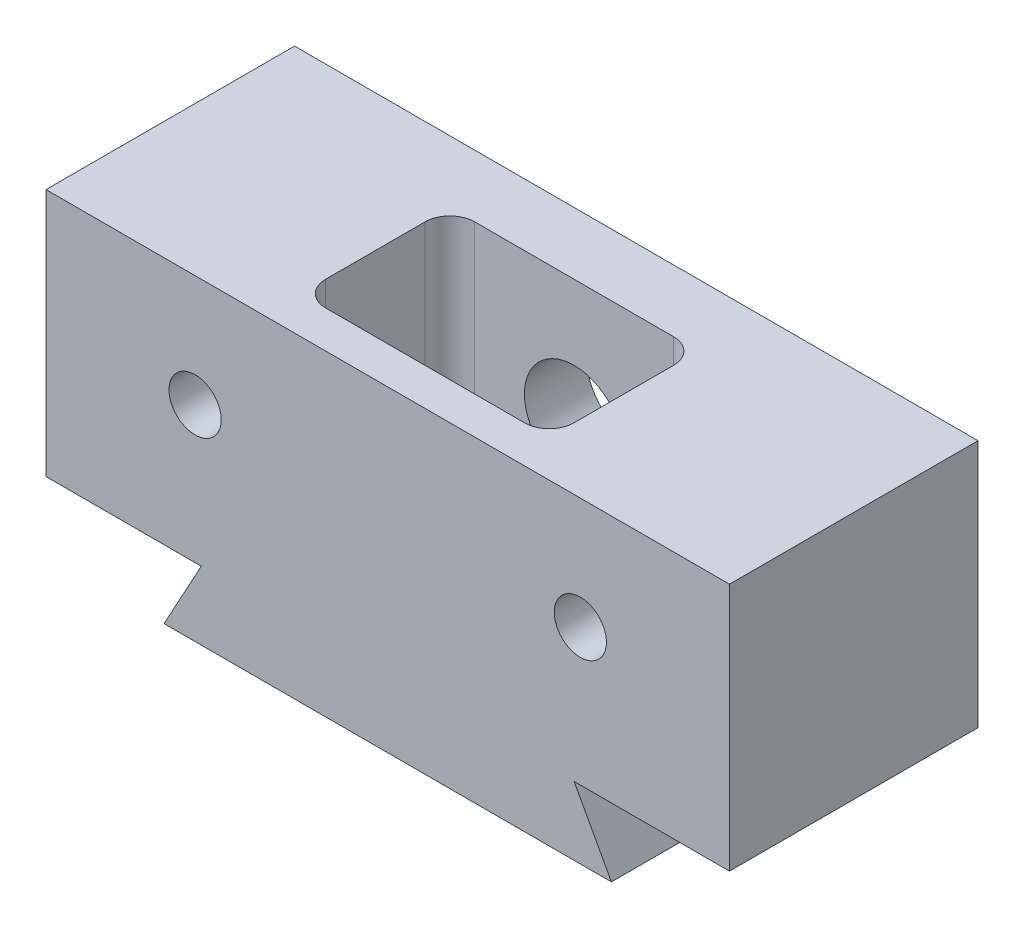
from build123d import *

# Parameters (mm, degrees)
BOSS_EXTRUDE1_DEPTH       = 20
CUT_EXTRUDE1_DEPTH        = 16
SKETCH3_R                 = 4
CUT_EXTRUDE2_DEPTH        = 5
M5X0_8_TAPPED_HOLE1_D     = 4.2
M5X0_8_TAPPED_HOLE1_DEPTH = 10
M5X0_8_TAPPED_HOLE1_TIP   = 1.2618073


with BuildPart() as part:
    # Sketch1 → Boss-Extrude1 (new body)
    with BuildSketch(Plane.XY):
        Polygon((12.5, 0), (9.5, -5.5), (45.5, -5.5), (42.5, 0), (55, 0), (55, 20), (0, 20), (0, 0), align=None)
    extrude(amount=BOSS_EXTRUDE1_DEPTH)

    # Sketch2 → Cut-Extrude1 (cut)
    with BuildSketch(Plane(origin=(0, 20, 0), x_dir=(1, 0, 0), z_dir=(0, 1, 0))):
        with BuildLine():
            Line((19.5, -5), (35.5, -5))
            ThreePointArc((35.5, -5), (36.914213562, -5.585786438), (37.5, -7))
            Line((37.5, -7), (37.5, -15))
            ThreePointArc((37.5, -15), (36.914213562, -16.414213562), (35.5, -17))
            Line((35.5, -17), (19.5, -17))
            ThreePointArc((19.5, -17), (18.085786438, -16.414213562), (17.5, -15))
            Line((17.5, -15), (17.5, -7))
            ThreePointArc((17.5, -7), (18.085786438, -5.585786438), (19.5, -5))
        make_face()
    extrude(amount=-CUT_EXTRUDE1_DEPTH, mode=Mode.SUBTRACT)

    # Sketch3 → Cut-Extrude2 (cut)
    with BuildSketch(Plane(origin=(0, 0, 0), x_dir=(-1, 0, 0), z_dir=(0, 0, -1))):
        with Locations((-27.5, 10)):
            Circle(SKETCH3_R)
    extrude(amount=-CUT_EXTRUDE2_DEPTH, mode=Mode.SUBTRACT)

    # M5x0.8 Tapped Hole1
    with Locations(Plane(origin=(12, 11, 20), x_dir=(1, 0, 0), z_dir=(0, 0, 1))):
        with Locations((0, 0), (31, 0)):
            Hole(M5X0_8_TAPPED_HOLE1_D / 2, depth=M5X0_8_TAPPED_HOLE1_DEPTH)
            with Locations((0, 0, -(M5X0_8_TAPPED_HOLE1_DEPTH + M5X0_8_TAPPED_HOLE1_TIP / 2))):  # 118° drill point
                Cone(0, M5X0_8_TAPPED_HOLE1_D / 2, M5X0_8_TAPPED_HOLE1_TIP, mode=Mode.SUBTRACT)


solid = part.part
